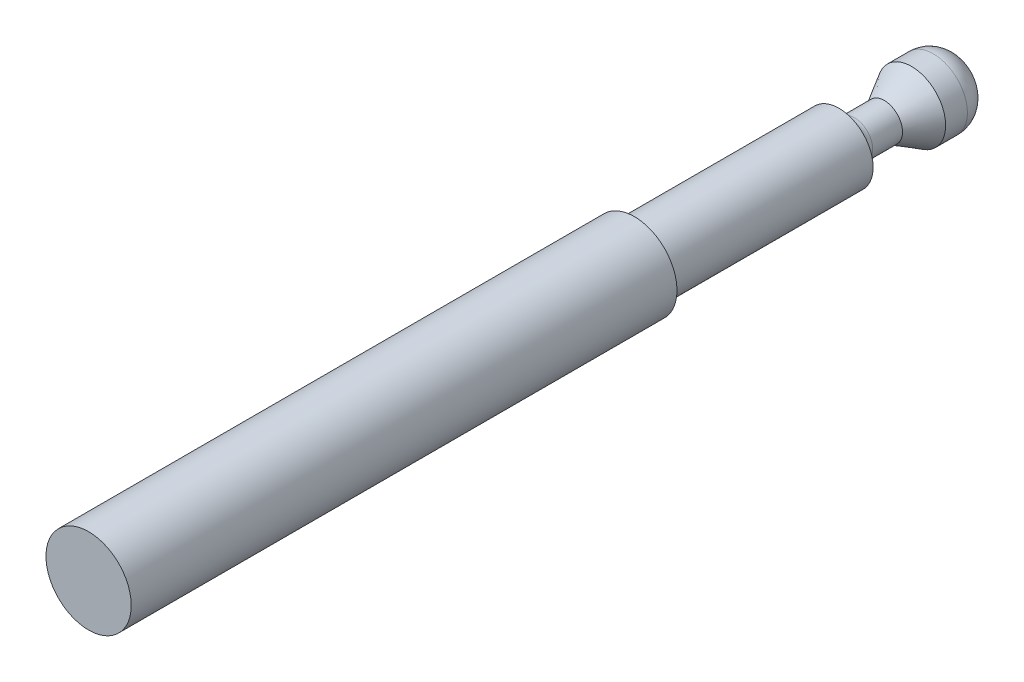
ISO-10303-21;
HEADER;
FILE_DESCRIPTION(('STEP AP214'),'2;1');
FILE_NAME('part.step','',(''),(''),'','','');
FILE_SCHEMA(('AUTOMOTIVE_DESIGN { 1 0 10303 214 1 1 1 1 }'));
ENDSEC;
DATA;
#1=APPLICATION_CONTEXT('core data for automotive mechanical design processes');
#2=APPLICATION_PROTOCOL_DEFINITION('international standard','automotive_design',2000,#1);
#3=PRODUCT_CONTEXT('',#1,'mechanical');
#4=PRODUCT('Part','Part','',(#3));
#5=PRODUCT_RELATED_PRODUCT_CATEGORY('part','',(#4));
#6=PRODUCT_DEFINITION_FORMATION('','',#4);
#7=PRODUCT_DEFINITION_CONTEXT('part definition',#1,'design');
#8=PRODUCT_DEFINITION('design','',#6,#7);
#9=PRODUCT_DEFINITION_SHAPE('','',#8);
#10=(LENGTH_UNIT() NAMED_UNIT(*) SI_UNIT(.MILLI.,.METRE.));
#11=(NAMED_UNIT(*) PLANE_ANGLE_UNIT() SI_UNIT($,.RADIAN.));
#12=(NAMED_UNIT(*) SI_UNIT($,.STERADIAN.) SOLID_ANGLE_UNIT());
#13=UNCERTAINTY_MEASURE_WITH_UNIT(LENGTH_MEASURE(1.E-05),#10,'distance_accuracy_value','');
#14=(GEOMETRIC_REPRESENTATION_CONTEXT(3) GLOBAL_UNCERTAINTY_ASSIGNED_CONTEXT((#13)) GLOBAL_UNIT_ASSIGNED_CONTEXT((#10,
#11,#12)) REPRESENTATION_CONTEXT('',''));
#15=CARTESIAN_POINT('',(0.,0.,0.));
#16=DIRECTION('',(0.,0.,1.));
#17=DIRECTION('',(1.,0.,0.));
#18=AXIS2_PLACEMENT_3D('',#15,#16,#17);
#19=CARTESIAN_POINT('',(0.,0.,-40.5));
#20=DIRECTION('',(0.,0.,-1.));
#21=DIRECTION('',(0.,-1.,0.));
#22=AXIS2_PLACEMENT_3D('',#19,#20,#21);
#23=CYLINDRICAL_SURFACE('',#22,5.);
#24=CARTESIAN_POINT('',(0.,0.,-64.));
#25=DIRECTION('',(0.,0.,-1.));
#26=DIRECTION('',(0.,-1.,0.));
#27=AXIS2_PLACEMENT_3D('',#24,#25,#26);
#28=CIRCLE('',#27,5.);
#29=CARTESIAN_POINT('',(0.,-5.,-64.));
#30=VERTEX_POINT('',#29);
#31=EDGE_CURVE('E48',#30,#30,#28,.T.);
#32=ORIENTED_EDGE('',*,*,#31,.F.);
#33=EDGE_LOOP('',(#32));
#34=FACE_BOUND('',#33,.T.);
#35=CARTESIAN_POINT('',(0.,0.,0.));
#36=DIRECTION('',(0.,0.,1.));
#37=DIRECTION('',(1.,0.,0.));
#38=AXIS2_PLACEMENT_3D('',#35,#36,#37);
#39=CIRCLE('',#38,5.);
#40=CARTESIAN_POINT('',(5.,0.,0.));
#41=VERTEX_POINT('',#40);
#42=EDGE_CURVE('E35',#41,#41,#39,.T.);
#43=ORIENTED_EDGE('',*,*,#42,.F.);
#44=EDGE_LOOP('',(#43));
#45=FACE_BOUND('',#44,.T.);
#46=ADVANCED_FACE('F14',(#34,#45),#23,.T.);
#47=CARTESIAN_POINT('',(-4.,0.,-64.));
#48=DIRECTION('',(0.,0.,-1.));
#49=DIRECTION('',(0.,-1.,0.));
#50=AXIS2_PLACEMENT_3D('',#47,#48,#49);
#51=PLANE('',#50);
#52=CARTESIAN_POINT('',(0.,0.,-64.));
#53=DIRECTION('',(0.,0.,-1.));
#54=DIRECTION('',(0.,-1.,0.));
#55=AXIS2_PLACEMENT_3D('',#52,#53,#54);
#56=CIRCLE('',#55,4.4);
#57=CARTESIAN_POINT('',(0.,-4.4,-64.));
#58=VERTEX_POINT('',#57);
#59=EDGE_CURVE('E63',#58,#58,#56,.F.);
#60=ORIENTED_EDGE('',*,*,#59,.T.);
#61=EDGE_LOOP('',(#60));
#62=FACE_BOUND('',#61,.T.);
#63=ORIENTED_EDGE('',*,*,#31,.T.);
#64=EDGE_LOOP('',(#63));
#65=FACE_BOUND('',#64,.T.);
#66=ADVANCED_FACE('F97',(#62,#65),#51,.T.);
#67=CARTESIAN_POINT('',(0.,0.,-64.4));
#68=DIRECTION('',(0.,0.,-1.));
#69=DIRECTION('',(0.,-1.,0.));
#70=AXIS2_PLACEMENT_3D('',#67,#68,#69);
#71=TOROIDAL_SURFACE('',#70,4.4,0.4);
#72=ORIENTED_EDGE('',*,*,#59,.F.);
#73=EDGE_LOOP('',(#72));
#74=FACE_BOUND('',#73,.T.);
#75=CARTESIAN_POINT('',(0.,0.,-64.4));
#76=DIRECTION('',(0.,0.,-1.));
#77=DIRECTION('',(0.,-1.,0.));
#78=AXIS2_PLACEMENT_3D('',#75,#76,#77);
#79=CIRCLE('',#78,4.);
#80=CARTESIAN_POINT('',(0.,-4.,-64.4));
#81=VERTEX_POINT('',#80);
#82=EDGE_CURVE('E60',#81,#81,#79,.T.);
#83=ORIENTED_EDGE('',*,*,#82,.F.);
#84=EDGE_LOOP('',(#83));
#85=FACE_BOUND('',#84,.T.);
#86=ADVANCED_FACE('F90',(#74,#85),#71,.F.);
#87=CARTESIAN_POINT('',(0.,0.,-40.5));
#88=DIRECTION('',(0.,0.,-1.));
#89=DIRECTION('',(0.,-1.,0.));
#90=AXIS2_PLACEMENT_3D('',#87,#88,#89);
#91=CYLINDRICAL_SURFACE('',#90,4.);
#92=ORIENTED_EDGE('',*,*,#82,.T.);
#93=EDGE_LOOP('',(#92));
#94=FACE_BOUND('',#93,.T.);
#95=CARTESIAN_POINT('',(0.,0.,-88.));
#96=DIRECTION('',(0.,0.,-1.));
#97=DIRECTION('',(0.,-1.,0.));
#98=AXIS2_PLACEMENT_3D('',#95,#96,#97);
#99=CIRCLE('',#98,4.);
#100=CARTESIAN_POINT('',(0.,-4.,-88.));
#101=VERTEX_POINT('',#100);
#102=EDGE_CURVE('E45',#101,#101,#99,.T.);
#103=ORIENTED_EDGE('',*,*,#102,.F.);
#104=EDGE_LOOP('',(#103));
#105=FACE_BOUND('',#104,.T.);
#106=ADVANCED_FACE('F82',(#94,#105),#91,.T.);
#107=CARTESIAN_POINT('',(-4.,0.,-88.));
#108=DIRECTION('',(0.,0.,-1.));
#109=DIRECTION('',(0.,-1.,0.));
#110=AXIS2_PLACEMENT_3D('',#107,#108,#109);
#111=PLANE('',#110);
#112=CARTESIAN_POINT('',(0.,0.,-88.));
#113=DIRECTION('',(0.,0.,-1.));
#114=DIRECTION('',(0.,-1.,0.));
#115=AXIS2_PLACEMENT_3D('',#112,#113,#114);
#116=CIRCLE('',#115,3.95);
#117=CARTESIAN_POINT('',(0.,-3.95,-88.));
#118=VERTEX_POINT('',#117);
#119=EDGE_CURVE('E9',#118,#118,#116,.F.);
#120=ORIENTED_EDGE('',*,*,#119,.T.);
#121=EDGE_LOOP('',(#120));
#122=FACE_BOUND('',#121,.T.);
#123=ORIENTED_EDGE('',*,*,#102,.T.);
#124=EDGE_LOOP('',(#123));
#125=FACE_BOUND('',#124,.T.);
#126=ADVANCED_FACE('F72',(#122,#125),#111,.T.);
#127=CARTESIAN_POINT('',(0.,0.,-89.8));
#128=DIRECTION('',(0.,0.,-1.));
#129=DIRECTION('',(0.,-1.,0.));
#130=AXIS2_PLACEMENT_3D('',#127,#128,#129);
#131=TOROIDAL_SURFACE('',#130,3.95,1.8);
#132=ORIENTED_EDGE('',*,*,#119,.F.);
#133=EDGE_LOOP('',(#132));
#134=FACE_BOUND('',#133,.T.);
#135=CARTESIAN_POINT('',(0.,0.,-89.8));
#136=DIRECTION('',(0.,0.,-1.));
#137=DIRECTION('',(0.,-1.,0.));
#138=AXIS2_PLACEMENT_3D('',#135,#136,#137);
#139=CIRCLE('',#138,2.15);
#140=CARTESIAN_POINT('',(0.,-2.15,-89.8));
#141=VERTEX_POINT('',#140);
#142=EDGE_CURVE('E21',#141,#141,#139,.T.);
#143=ORIENTED_EDGE('',*,*,#142,.F.);
#144=EDGE_LOOP('',(#143));
#145=FACE_BOUND('',#144,.T.);
#146=ADVANCED_FACE('F16',(#134,#145),#131,.F.);
#147=CARTESIAN_POINT('',(0.,0.,-40.5));
#148=DIRECTION('',(0.,0.,-1.));
#149=DIRECTION('',(0.,-1.,0.));
#150=AXIS2_PLACEMENT_3D('',#147,#148,#149);
#151=CYLINDRICAL_SURFACE('',#150,2.15);
#152=ORIENTED_EDGE('',*,*,#142,.T.);
#153=EDGE_LOOP('',(#152));
#154=FACE_BOUND('',#153,.T.);
#155=CARTESIAN_POINT('',(0.,0.,-93.3));
#156=DIRECTION('',(0.,0.,-1.));
#157=DIRECTION('',(0.,-1.,0.));
#158=AXIS2_PLACEMENT_3D('',#155,#156,#157);
#159=CIRCLE('',#158,2.15);
#160=CARTESIAN_POINT('',(0.,-2.15,-93.3));
#161=VERTEX_POINT('',#160);
#162=EDGE_CURVE('E54',#161,#161,#159,.T.);
#163=ORIENTED_EDGE('',*,*,#162,.F.);
#164=EDGE_LOOP('',(#163));
#165=FACE_BOUND('',#164,.T.);
#166=ADVANCED_FACE('F68',(#154,#165),#151,.T.);
#167=CARTESIAN_POINT('',(0.,0.,-96.5042939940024));
#168=DIRECTION('',(0.,0.,-1.));
#169=DIRECTION('',(0.,-1.,0.));
#170=AXIS2_PLACEMENT_3D('',#167,#168,#169);
#171=CONICAL_SURFACE('',#170,4.,0.523598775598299);
#172=ORIENTED_EDGE('',*,*,#162,.T.);
#173=EDGE_LOOP('',(#172));
#174=FACE_BOUND('',#173,.T.);
#175=CARTESIAN_POINT('',(0.,0.,-96.5042939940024));
#176=DIRECTION('',(0.,0.,-1.));
#177=DIRECTION('',(0.,-1.,0.));
#178=AXIS2_PLACEMENT_3D('',#175,#176,#177);
#179=CIRCLE('',#178,4.);
#180=CARTESIAN_POINT('',(0.,-4.,-96.5042939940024));
#181=VERTEX_POINT('',#180);
#182=EDGE_CURVE('E51',#181,#181,#179,.T.);
#183=ORIENTED_EDGE('',*,*,#182,.F.);
#184=EDGE_LOOP('',(#183));
#185=FACE_BOUND('',#184,.T.);
#186=ADVANCED_FACE('F80',(#174,#185),#171,.T.);
#187=CARTESIAN_POINT('',(0.,0.,-40.5));
#188=DIRECTION('',(0.,0.,-1.));
#189=DIRECTION('',(0.,-1.,0.));
#190=AXIS2_PLACEMENT_3D('',#187,#188,#189);
#191=CYLINDRICAL_SURFACE('',#190,4.);
#192=CARTESIAN_POINT('',(0.,0.,-99.0606123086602));
#193=DIRECTION('',(0.,0.,-1.));
#194=DIRECTION('',(0.,-1.,0.));
#195=AXIS2_PLACEMENT_3D('',#192,#193,#194);
#196=CIRCLE('',#195,4.);
#197=CARTESIAN_POINT('',(0.,-4.,-99.0606123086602));
#198=VERTEX_POINT('',#197);
#199=EDGE_CURVE('E57',#198,#198,#196,.F.);
#200=ORIENTED_EDGE('',*,*,#199,.T.);
#201=EDGE_LOOP('',(#200));
#202=FACE_BOUND('',#201,.T.);
#203=ORIENTED_EDGE('',*,*,#182,.T.);
#204=EDGE_LOOP('',(#203));
#205=FACE_BOUND('',#204,.T.);
#206=ADVANCED_FACE('F107',(#202,#205),#191,.T.);
#207=CARTESIAN_POINT('',(0.,0.,-99.0606123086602));
#208=DIRECTION('',(0.,0.,-1.));
#209=DIRECTION('',(0.,-1.,0.));
#210=AXIS2_PLACEMENT_3D('',#207,#208,#209);
#211=DEGENERATE_TOROIDAL_SURFACE('',#210,1.,3.,.T.);
#212=ORIENTED_EDGE('',*,*,#199,.F.);
#213=EDGE_LOOP('',(#212));
#214=FACE_BOUND('',#213,.T.);
#215=CARTESIAN_POINT('',(0.,0.,-102.));
#216=DIRECTION('',(0.,0.,-1.));
#217=DIRECTION('',(0.,-1.,0.));
#218=AXIS2_PLACEMENT_3D('',#215,#216,#217);
#219=CIRCLE('',#218,1.6);
#220=CARTESIAN_POINT('',(0.,-1.6,-102.));
#221=VERTEX_POINT('',#220);
#222=EDGE_CURVE('E38',#221,#221,#219,.T.);
#223=ORIENTED_EDGE('',*,*,#222,.F.);
#224=EDGE_LOOP('',(#223));
#225=FACE_BOUND('',#224,.T.);
#226=ADVANCED_FACE('F110',(#214,#225),#211,.T.);
#227=CARTESIAN_POINT('',(0.,0.,-102.));
#228=DIRECTION('',(0.,0.,-1.));
#229=DIRECTION('',(0.,-1.,0.));
#230=AXIS2_PLACEMENT_3D('',#227,#228,#229);
#231=CONICAL_SURFACE('',#230,1.6,0.523598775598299);
#232=CARTESIAN_POINT('',(0.,0.,-100.960769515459));
#233=DIRECTION('',(0.,0.,-1.));
#234=DIRECTION('',(0.,-1.,0.));
#235=AXIS2_PLACEMENT_3D('',#232,#233,#234);
#236=CIRCLE('',#235,1.);
#237=CARTESIAN_POINT('',(0.,-1.,-100.960769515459));
#238=VERTEX_POINT('',#237);
#239=EDGE_CURVE('E34',#238,#238,#236,.T.);
#240=ORIENTED_EDGE('',*,*,#239,.F.);
#241=EDGE_LOOP('',(#240));
#242=FACE_BOUND('',#241,.T.);
#243=ORIENTED_EDGE('',*,*,#222,.T.);
#244=EDGE_LOOP('',(#243));
#245=FACE_BOUND('',#244,.T.);
#246=ADVANCED_FACE('F116',(#242,#245),#231,.F.);
#247=CARTESIAN_POINT('',(0.,0.,-102.));
#248=DIRECTION('',(0.,0.,-1.));
#249=DIRECTION('',(0.,-1.,0.));
#250=AXIS2_PLACEMENT_3D('',#247,#248,#249);
#251=CYLINDRICAL_SURFACE('',#250,1.);
#252=CARTESIAN_POINT('',(0.,0.,-99.));
#253=DIRECTION('',(0.,0.,-1.));
#254=DIRECTION('',(0.,-1.,0.));
#255=AXIS2_PLACEMENT_3D('',#252,#253,#254);
#256=CIRCLE('',#255,1.);
#257=CARTESIAN_POINT('',(0.,-1.,-99.));
#258=VERTEX_POINT('',#257);
#259=EDGE_CURVE('E32',#258,#258,#256,.T.);
#260=ORIENTED_EDGE('',*,*,#259,.F.);
#261=EDGE_LOOP('',(#260));
#262=FACE_BOUND('',#261,.T.);
#263=ORIENTED_EDGE('',*,*,#239,.T.);
#264=EDGE_LOOP('',(#263));
#265=FACE_BOUND('',#264,.T.);
#266=ADVANCED_FACE('F28',(#262,#265),#251,.F.);
#267=CARTESIAN_POINT('',(0.,0.,-99.));
#268=DIRECTION('',(0.,0.,-1.));
#269=DIRECTION('',(0.,-1.,0.));
#270=AXIS2_PLACEMENT_3D('',#267,#268,#269);
#271=CONICAL_SURFACE('',#270,1.,1.02974425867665);
#272=CARTESIAN_POINT('',(0.,0.,-98.3991393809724));
#273=VERTEX_POINT('',#272);
#274=VERTEX_LOOP('',#273);
#275=FACE_BOUND('',#274,.T.);
#276=ORIENTED_EDGE('',*,*,#259,.T.);
#277=EDGE_LOOP('',(#276));
#278=FACE_BOUND('',#277,.T.);
#279=ADVANCED_FACE('F24',(#275,#278),#271,.F.);
#280=CARTESIAN_POINT('',(0.,0.,0.));
#281=DIRECTION('',(0.,0.,1.));
#282=DIRECTION('',(1.,0.,0.));
#283=AXIS2_PLACEMENT_3D('',#280,#281,#282);
#284=PLANE('',#283);
#285=ORIENTED_EDGE('',*,*,#42,.T.);
#286=EDGE_LOOP('',(#285));
#287=FACE_BOUND('',#286,.T.);
#288=ADVANCED_FACE('F27',(#287),#284,.T.);
#289=CLOSED_SHELL('',(#46,#66,#86,#106,#126,#146,#166,#186,#206,#226,#246,#266,#279,#288));
#290=MANIFOLD_SOLID_BREP('B1',#289);
#291=ADVANCED_BREP_SHAPE_REPRESENTATION('',(#18,#290),#14);
#292=SHAPE_DEFINITION_REPRESENTATION(#9,#291);
ENDSEC;
END-ISO-10303-21;
